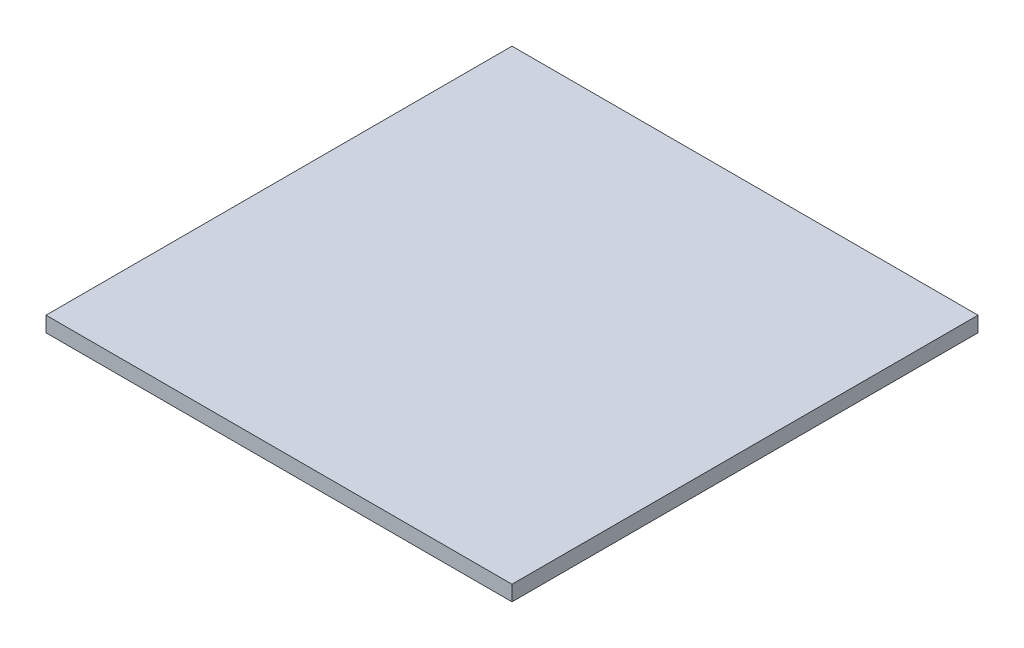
ISO-10303-21;
HEADER;
FILE_DESCRIPTION(('STEP AP214'),'2;1');
FILE_NAME('part.step','',(''),(''),'','','');
FILE_SCHEMA(('AUTOMOTIVE_DESIGN { 1 0 10303 214 1 1 1 1 }'));
ENDSEC;
DATA;
#1=APPLICATION_CONTEXT('core data for automotive mechanical design processes');
#2=APPLICATION_PROTOCOL_DEFINITION('international standard','automotive_design',2000,#1);
#3=PRODUCT_CONTEXT('',#1,'mechanical');
#4=PRODUCT('Part','Part','',(#3));
#5=PRODUCT_RELATED_PRODUCT_CATEGORY('part','',(#4));
#6=PRODUCT_DEFINITION_FORMATION('','',#4);
#7=PRODUCT_DEFINITION_CONTEXT('part definition',#1,'design');
#8=PRODUCT_DEFINITION('design','',#6,#7);
#9=PRODUCT_DEFINITION_SHAPE('','',#8);
#10=(LENGTH_UNIT() NAMED_UNIT(*) SI_UNIT(.MILLI.,.METRE.));
#11=(NAMED_UNIT(*) PLANE_ANGLE_UNIT() SI_UNIT($,.RADIAN.));
#12=(NAMED_UNIT(*) SI_UNIT($,.STERADIAN.) SOLID_ANGLE_UNIT());
#13=UNCERTAINTY_MEASURE_WITH_UNIT(LENGTH_MEASURE(1.E-05),#10,'distance_accuracy_value','');
#14=(GEOMETRIC_REPRESENTATION_CONTEXT(3) GLOBAL_UNCERTAINTY_ASSIGNED_CONTEXT((#13)) GLOBAL_UNIT_ASSIGNED_CONTEXT((#10,
#11,#12)) REPRESENTATION_CONTEXT('',''));
#15=CARTESIAN_POINT('',(0.,0.,0.));
#16=DIRECTION('',(0.,0.,1.));
#17=DIRECTION('',(1.,0.,0.));
#18=AXIS2_PLACEMENT_3D('',#15,#16,#17);
#19=CARTESIAN_POINT('',(-19.05,1.25,-19.05));
#20=DIRECTION('',(1.,0.,0.));
#21=DIRECTION('',(0.,0.,-1.));
#22=AXIS2_PLACEMENT_3D('',#19,#20,#21);
#23=PLANE('',#22);
#24=DIRECTION('',(0.,0.,1.));
#25=VECTOR('',#24,1.);
#26=CARTESIAN_POINT('',(-19.05,0.,-19.05));
#27=LINE('',#26,#25);
#28=CARTESIAN_POINT('',(-19.05,0.,-19.05));
#29=VERTEX_POINT('',#28);
#30=CARTESIAN_POINT('',(-19.05,0.,19.05));
#31=VERTEX_POINT('',#30);
#32=EDGE_CURVE('E100',#29,#31,#27,.T.);
#33=ORIENTED_EDGE('',*,*,#32,.T.);
#34=DIRECTION('',(0.,-1.,0.));
#35=VECTOR('',#34,1.);
#36=CARTESIAN_POINT('',(-19.05,1.25,19.05));
#37=LINE('',#36,#35);
#38=CARTESIAN_POINT('',(-19.05,1.25,19.05));
#39=VERTEX_POINT('',#38);
#40=EDGE_CURVE('E11',#39,#31,#37,.T.);
#41=ORIENTED_EDGE('',*,*,#40,.F.);
#42=DIRECTION('',(0.,0.,1.));
#43=VECTOR('',#42,1.);
#44=CARTESIAN_POINT('',(-19.05,1.25,-19.05));
#45=LINE('',#44,#43);
#46=CARTESIAN_POINT('',(-19.05,1.25,-19.05));
#47=VERTEX_POINT('',#46);
#48=EDGE_CURVE('E88',#47,#39,#45,.T.);
#49=ORIENTED_EDGE('',*,*,#48,.F.);
#50=DIRECTION('',(0.,-1.,0.));
#51=VECTOR('',#50,1.);
#52=CARTESIAN_POINT('',(-19.05,1.25,-19.05));
#53=LINE('',#52,#51);
#54=EDGE_CURVE('E96',#47,#29,#53,.T.);
#55=ORIENTED_EDGE('',*,*,#54,.T.);
#56=EDGE_LOOP('',(#33,#41,#49,#55));
#57=FACE_BOUND('',#56,.T.);
#58=ADVANCED_FACE('F37',(#57),#23,.F.);
#59=CARTESIAN_POINT('',(-19.05,1.25,19.05));
#60=DIRECTION('',(0.,0.,-1.));
#61=DIRECTION('',(-1.,0.,0.));
#62=AXIS2_PLACEMENT_3D('',#59,#60,#61);
#63=PLANE('',#62);
#64=DIRECTION('',(1.,0.,0.));
#65=VECTOR('',#64,1.);
#66=CARTESIAN_POINT('',(-19.05,0.,19.05));
#67=LINE('',#66,#65);
#68=CARTESIAN_POINT('',(19.05,0.,19.05));
#69=VERTEX_POINT('',#68);
#70=EDGE_CURVE('E92',#31,#69,#67,.T.);
#71=ORIENTED_EDGE('',*,*,#70,.T.);
#72=DIRECTION('',(0.,-1.,0.));
#73=VECTOR('',#72,1.);
#74=CARTESIAN_POINT('',(19.05,1.25,19.05));
#75=LINE('',#74,#73);
#76=CARTESIAN_POINT('',(19.05,1.25,19.05));
#77=VERTEX_POINT('',#76);
#78=EDGE_CURVE('E45',#77,#69,#75,.T.);
#79=ORIENTED_EDGE('',*,*,#78,.F.);
#80=DIRECTION('',(1.,0.,0.));
#81=VECTOR('',#80,1.);
#82=CARTESIAN_POINT('',(-19.05,1.25,19.05));
#83=LINE('',#82,#81);
#84=EDGE_CURVE('E83',#39,#77,#83,.T.);
#85=ORIENTED_EDGE('',*,*,#84,.F.);
#86=ORIENTED_EDGE('',*,*,#40,.T.);
#87=EDGE_LOOP('',(#71,#79,#85,#86));
#88=FACE_BOUND('',#87,.T.);
#89=ADVANCED_FACE('F91',(#88),#63,.F.);
#90=CARTESIAN_POINT('',(19.05,1.25,-19.05));
#91=DIRECTION('',(-1.,0.,0.));
#92=DIRECTION('',(0.,0.,1.));
#93=AXIS2_PLACEMENT_3D('',#90,#91,#92);
#94=PLANE('',#93);
#95=DIRECTION('',(0.,0.,-1.));
#96=VECTOR('',#95,1.);
#97=CARTESIAN_POINT('',(19.05,0.,-19.05));
#98=LINE('',#97,#96);
#99=CARTESIAN_POINT('',(19.05,0.,-19.05));
#100=VERTEX_POINT('',#99);
#101=EDGE_CURVE('E70',#69,#100,#98,.T.);
#102=ORIENTED_EDGE('',*,*,#101,.T.);
#103=DIRECTION('',(0.,-1.,0.));
#104=VECTOR('',#103,1.);
#105=CARTESIAN_POINT('',(19.05,1.25,-19.05));
#106=LINE('',#105,#104);
#107=CARTESIAN_POINT('',(19.05,1.25,-19.05));
#108=VERTEX_POINT('',#107);
#109=EDGE_CURVE('E93',#108,#100,#106,.T.);
#110=ORIENTED_EDGE('',*,*,#109,.F.);
#111=DIRECTION('',(0.,0.,-1.));
#112=VECTOR('',#111,1.);
#113=CARTESIAN_POINT('',(19.05,1.25,-19.05));
#114=LINE('',#113,#112);
#115=EDGE_CURVE('E86',#77,#108,#114,.T.);
#116=ORIENTED_EDGE('',*,*,#115,.F.);
#117=ORIENTED_EDGE('',*,*,#78,.T.);
#118=EDGE_LOOP('',(#102,#110,#116,#117));
#119=FACE_BOUND('',#118,.T.);
#120=ADVANCED_FACE('F94',(#119),#94,.F.);
#121=CARTESIAN_POINT('',(-19.05,1.25,-19.05));
#122=DIRECTION('',(0.,0.,1.));
#123=DIRECTION('',(1.,0.,0.));
#124=AXIS2_PLACEMENT_3D('',#121,#122,#123);
#125=PLANE('',#124);
#126=DIRECTION('',(-1.,0.,0.));
#127=VECTOR('',#126,1.);
#128=CARTESIAN_POINT('',(-19.05,0.,-19.05));
#129=LINE('',#128,#127);
#130=EDGE_CURVE('E76',#100,#29,#129,.T.);
#131=ORIENTED_EDGE('',*,*,#130,.T.);
#132=ORIENTED_EDGE('',*,*,#54,.F.);
#133=DIRECTION('',(-1.,0.,0.));
#134=VECTOR('',#133,1.);
#135=CARTESIAN_POINT('',(-19.05,1.25,-19.05));
#136=LINE('',#135,#134);
#137=EDGE_CURVE('E53',#108,#47,#136,.T.);
#138=ORIENTED_EDGE('',*,*,#137,.F.);
#139=ORIENTED_EDGE('',*,*,#109,.T.);
#140=EDGE_LOOP('',(#131,#132,#138,#139));
#141=FACE_BOUND('',#140,.T.);
#142=ADVANCED_FACE('F107',(#141),#125,.F.);
#143=CARTESIAN_POINT('',(0.,1.25,0.));
#144=DIRECTION('',(0.,1.,0.));
#145=DIRECTION('',(0.,0.,1.));
#146=AXIS2_PLACEMENT_3D('',#143,#144,#145);
#147=PLANE('',#146);
#148=ORIENTED_EDGE('',*,*,#48,.T.);
#149=ORIENTED_EDGE('',*,*,#84,.T.);
#150=ORIENTED_EDGE('',*,*,#115,.T.);
#151=ORIENTED_EDGE('',*,*,#137,.T.);
#152=EDGE_LOOP('',(#148,#149,#150,#151));
#153=FACE_BOUND('',#152,.T.);
#154=ADVANCED_FACE('F84',(#153),#147,.T.);
#155=CARTESIAN_POINT('',(0.,0.,0.));
#156=DIRECTION('',(0.,1.,0.));
#157=DIRECTION('',(0.,0.,1.));
#158=AXIS2_PLACEMENT_3D('',#155,#156,#157);
#159=PLANE('',#158);
#160=ORIENTED_EDGE('',*,*,#32,.F.);
#161=ORIENTED_EDGE('',*,*,#130,.F.);
#162=ORIENTED_EDGE('',*,*,#101,.F.);
#163=ORIENTED_EDGE('',*,*,#70,.F.);
#164=EDGE_LOOP('',(#160,#161,#162,#163));
#165=FACE_BOUND('',#164,.T.);
#166=ADVANCED_FACE('F110',(#165),#159,.F.);
#167=CLOSED_SHELL('',(#58,#89,#120,#142,#154,#166));
#168=MANIFOLD_SOLID_BREP('B2',#167);
#169=ADVANCED_BREP_SHAPE_REPRESENTATION('',(#18,#168),#14);
#170=SHAPE_DEFINITION_REPRESENTATION(#9,#169);
ENDSEC;
END-ISO-10303-21;
